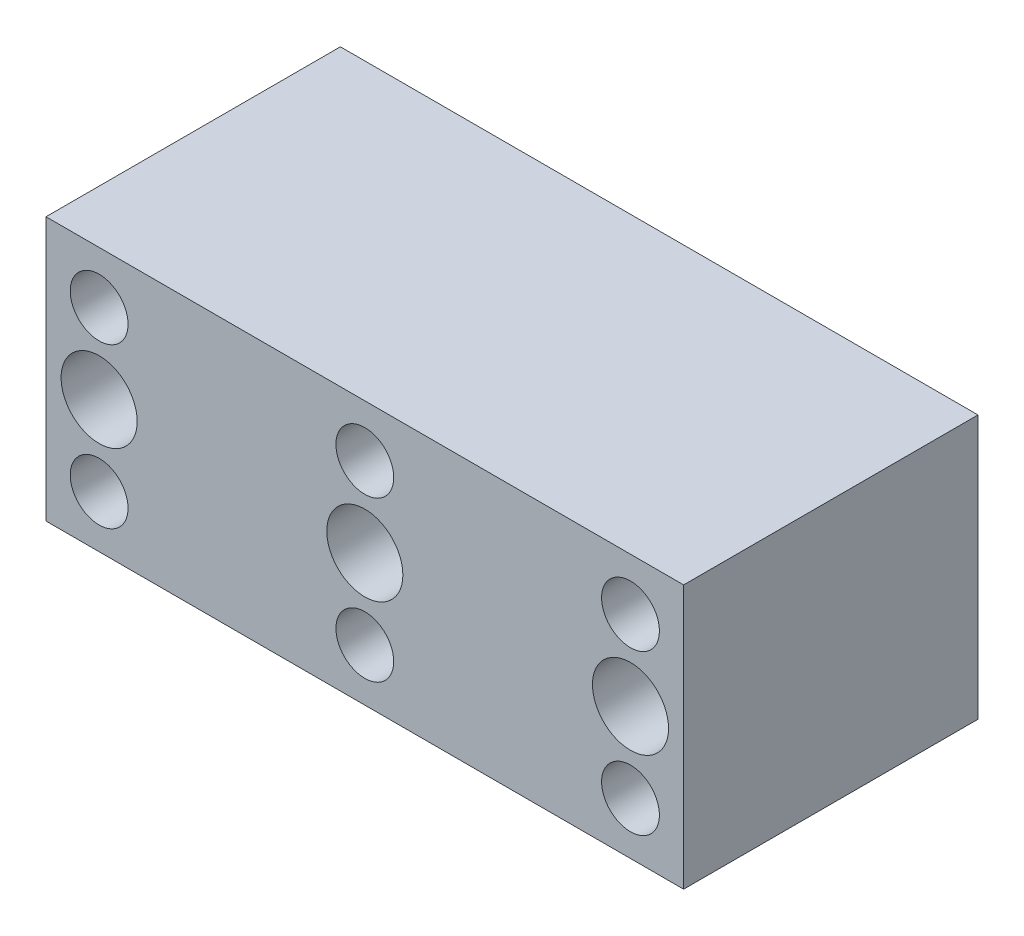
from build123d import *

# Parameters (mm, degrees)
SKETCH1_W                    = 76.2
SKETCH1_H                    = 31.496
BOSS_EXTRUDE1_DEPTH          = 35.179
SKETCH2_R                    = 2.1082
CUT_EXTRUDE1_DEPTH           = 90.643739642
SKETCH3_R                    = 3.4544
CUT_EXTRUDE2_DEPTH           = 5.08
F_1_8_27_NPSM_TAPPED_HOLE1_D = 9.0932


with BuildPart() as part:
    # Sketch1 → Boss-Extrude1 (new body)
    with BuildSketch(Plane.XY):
        with Locations((38.1, 15.748)):
            Rectangle(SKETCH1_W, SKETCH1_H)
    extrude(amount=-BOSS_EXTRUDE1_DEPTH)

    # Sketch2 → Cut-Extrude1 (cut, through all)
    with BuildSketch(Plane.XY):
        with Locations((6.35, 25.273)):
            Circle(SKETCH2_R)
        with Locations((38.1, 25.273)):
            Circle(SKETCH2_R)
        with Locations((69.85, 25.273)):
            Circle(SKETCH2_R)
        with Locations((69.85, 6.223)):
            Circle(SKETCH2_R)
        with Locations((38.1, 6.223)):
            Circle(SKETCH2_R)
        with Locations((6.35, 6.223)):
            Circle(SKETCH2_R)
    extrude(amount=-CUT_EXTRUDE1_DEPTH, mode=Mode.SUBTRACT)

    # Sketch3 → Cut-Extrude2 (cut)
    with BuildSketch(Plane.XY):
        with Locations((6.35, 25.273)):
            Circle(SKETCH3_R)
        with Locations((38.1, 25.273)):
            Circle(SKETCH3_R)
        with Locations((69.85, 25.273)):
            Circle(SKETCH3_R)
        with Locations((69.85, 6.223)):
            Circle(SKETCH3_R)
        with Locations((38.1, 6.223)):
            Circle(SKETCH3_R)
        with Locations((6.35, 6.223)):
            Circle(SKETCH3_R)
    extrude(amount=-CUT_EXTRUDE2_DEPTH, mode=Mode.SUBTRACT)

    # 1_8-27 NPSM Tapped Hole1 (through all)
    with Locations(Plane.XY):
        with Locations((6.35, 15.748), (38.1, 15.748), (69.85, 15.748)):
            Hole(F_1_8_27_NPSM_TAPPED_HOLE1_D / 2)


solid = part.part
